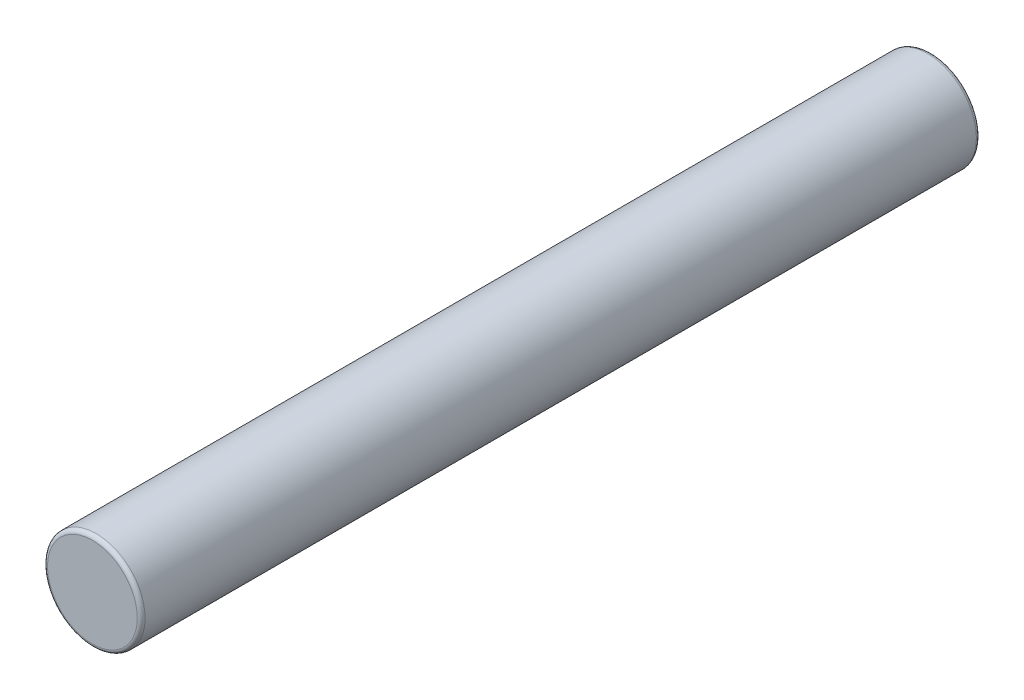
ISO-10303-21;
HEADER;
FILE_DESCRIPTION(('STEP AP214'),'2;1');
FILE_NAME('part.step','',(''),(''),'','','');
FILE_SCHEMA(('AUTOMOTIVE_DESIGN { 1 0 10303 214 1 1 1 1 }'));
ENDSEC;
DATA;
#1=APPLICATION_CONTEXT('core data for automotive mechanical design processes');
#2=APPLICATION_PROTOCOL_DEFINITION('international standard','automotive_design',2000,#1);
#3=PRODUCT_CONTEXT('',#1,'mechanical');
#4=PRODUCT('Part','Part','',(#3));
#5=PRODUCT_RELATED_PRODUCT_CATEGORY('part','',(#4));
#6=PRODUCT_DEFINITION_FORMATION('','',#4);
#7=PRODUCT_DEFINITION_CONTEXT('part definition',#1,'design');
#8=PRODUCT_DEFINITION('design','',#6,#7);
#9=PRODUCT_DEFINITION_SHAPE('','',#8);
#10=(LENGTH_UNIT() NAMED_UNIT(*) SI_UNIT(.MILLI.,.METRE.));
#11=(NAMED_UNIT(*) PLANE_ANGLE_UNIT() SI_UNIT($,.RADIAN.));
#12=(NAMED_UNIT(*) SI_UNIT($,.STERADIAN.) SOLID_ANGLE_UNIT());
#13=UNCERTAINTY_MEASURE_WITH_UNIT(LENGTH_MEASURE(1.E-05),#10,'distance_accuracy_value','');
#14=(GEOMETRIC_REPRESENTATION_CONTEXT(3) GLOBAL_UNCERTAINTY_ASSIGNED_CONTEXT((#13)) GLOBAL_UNIT_ASSIGNED_CONTEXT((#10,
#11,#12)) REPRESENTATION_CONTEXT('',''));
#15=CARTESIAN_POINT('',(0.,0.,0.));
#16=DIRECTION('',(0.,0.,1.));
#17=DIRECTION('',(1.,0.,0.));
#18=AXIS2_PLACEMENT_3D('',#15,#16,#17);
#19=CARTESIAN_POINT('',(0.,0.,21.5));
#20=DIRECTION('',(0.,0.,-1.));
#21=DIRECTION('',(-1.,0.,0.));
#22=AXIS2_PLACEMENT_3D('',#19,#20,#21);
#23=CYLINDRICAL_SURFACE('',#22,2.5);
#24=CARTESIAN_POINT('',(0.,0.,-21.3));
#25=DIRECTION('',(0.,0.,1.));
#26=DIRECTION('',(1.,0.,0.));
#27=AXIS2_PLACEMENT_3D('',#24,#25,#26);
#28=CIRCLE('',#27,2.5);
#29=CARTESIAN_POINT('',(2.5,0.,-21.3));
#30=VERTEX_POINT('',#29);
#31=EDGE_CURVE('E41',#30,#30,#28,.T.);
#32=ORIENTED_EDGE('',*,*,#31,.T.);
#33=EDGE_LOOP('',(#32));
#34=FACE_BOUND('',#33,.T.);
#35=CARTESIAN_POINT('',(0.,0.,21.3));
#36=DIRECTION('',(0.,0.,1.));
#37=DIRECTION('',(1.,0.,0.));
#38=AXIS2_PLACEMENT_3D('',#35,#36,#37);
#39=CIRCLE('',#38,2.5);
#40=CARTESIAN_POINT('',(2.5,0.,21.3));
#41=VERTEX_POINT('',#40);
#42=EDGE_CURVE('E45',#41,#41,#39,.F.);
#43=ORIENTED_EDGE('',*,*,#42,.T.);
#44=EDGE_LOOP('',(#43));
#45=FACE_BOUND('',#44,.T.);
#46=ADVANCED_FACE('F31',(#34,#45),#23,.T.);
#47=CARTESIAN_POINT('',(0.,0.,21.5));
#48=DIRECTION('',(0.,0.,1.));
#49=DIRECTION('',(1.,0.,0.));
#50=AXIS2_PLACEMENT_3D('',#47,#48,#49);
#51=PLANE('',#50);
#52=CARTESIAN_POINT('',(0.,0.,21.5));
#53=DIRECTION('',(0.,0.,1.));
#54=DIRECTION('',(1.,0.,0.));
#55=AXIS2_PLACEMENT_3D('',#52,#53,#54);
#56=CIRCLE('',#55,2.3);
#57=CARTESIAN_POINT('',(2.3,0.,21.5));
#58=VERTEX_POINT('',#57);
#59=EDGE_CURVE('E10',#58,#58,#56,.T.);
#60=ORIENTED_EDGE('',*,*,#59,.T.);
#61=EDGE_LOOP('',(#60));
#62=FACE_BOUND('',#61,.T.);
#63=ADVANCED_FACE('F64',(#62),#51,.T.);
#64=CARTESIAN_POINT('',(0.,0.,-21.5));
#65=DIRECTION('',(0.,0.,1.));
#66=DIRECTION('',(1.,0.,0.));
#67=AXIS2_PLACEMENT_3D('',#64,#65,#66);
#68=PLANE('',#67);
#69=CARTESIAN_POINT('',(0.,0.,-21.5));
#70=DIRECTION('',(0.,0.,1.));
#71=DIRECTION('',(1.,0.,0.));
#72=AXIS2_PLACEMENT_3D('',#69,#70,#71);
#73=CIRCLE('',#72,2.3);
#74=CARTESIAN_POINT('',(2.3,0.,-21.5));
#75=VERTEX_POINT('',#74);
#76=EDGE_CURVE('E37',#75,#75,#73,.F.);
#77=ORIENTED_EDGE('',*,*,#76,.T.);
#78=EDGE_LOOP('',(#77));
#79=FACE_BOUND('',#78,.T.);
#80=ADVANCED_FACE('F60',(#79),#68,.F.);
#81=CARTESIAN_POINT('',(0.,0.,-21.3));
#82=DIRECTION('',(0.,0.,1.));
#83=DIRECTION('',(1.,0.,0.));
#84=AXIS2_PLACEMENT_3D('',#81,#82,#83);
#85=TOROIDAL_SURFACE('',#84,2.3,0.2);
#86=ORIENTED_EDGE('',*,*,#76,.F.);
#87=EDGE_LOOP('',(#86));
#88=FACE_BOUND('',#87,.T.);
#89=ORIENTED_EDGE('',*,*,#31,.F.);
#90=EDGE_LOOP('',(#89));
#91=FACE_BOUND('',#90,.T.);
#92=ADVANCED_FACE('F55',(#88,#91),#85,.T.);
#93=CARTESIAN_POINT('',(0.,0.,21.3));
#94=DIRECTION('',(0.,0.,1.));
#95=DIRECTION('',(1.,0.,0.));
#96=AXIS2_PLACEMENT_3D('',#93,#94,#95);
#97=TOROIDAL_SURFACE('',#96,2.3,0.2);
#98=ORIENTED_EDGE('',*,*,#42,.F.);
#99=EDGE_LOOP('',(#98));
#100=FACE_BOUND('',#99,.T.);
#101=ORIENTED_EDGE('',*,*,#59,.F.);
#102=EDGE_LOOP('',(#101));
#103=FACE_BOUND('',#102,.T.);
#104=ADVANCED_FACE('F52',(#100,#103),#97,.T.);
#105=CLOSED_SHELL('',(#46,#63,#80,#92,#104));
#106=MANIFOLD_SOLID_BREP('B2',#105);
#107=ADVANCED_BREP_SHAPE_REPRESENTATION('',(#18,#106),#14);
#108=SHAPE_DEFINITION_REPRESENTATION(#9,#107);
ENDSEC;
END-ISO-10303-21;
